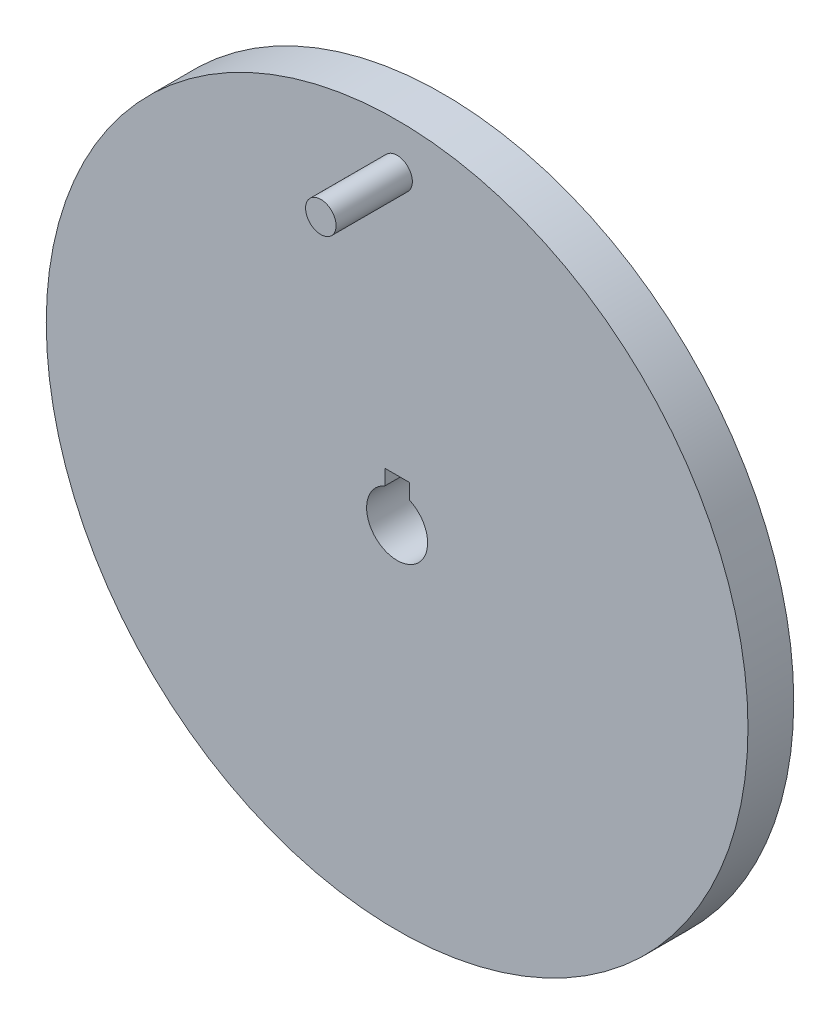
ISO-10303-21;
HEADER;
FILE_DESCRIPTION(('STEP AP214'),'2;1');
FILE_NAME('part.step','',(''),(''),'','','');
FILE_SCHEMA(('AUTOMOTIVE_DESIGN { 1 0 10303 214 1 1 1 1 }'));
ENDSEC;
DATA;
#1=APPLICATION_CONTEXT('core data for automotive mechanical design processes');
#2=APPLICATION_PROTOCOL_DEFINITION('international standard','automotive_design',2000,#1);
#3=PRODUCT_CONTEXT('',#1,'mechanical');
#4=PRODUCT('Part','Part','',(#3));
#5=PRODUCT_RELATED_PRODUCT_CATEGORY('part','',(#4));
#6=PRODUCT_DEFINITION_FORMATION('','',#4);
#7=PRODUCT_DEFINITION_CONTEXT('part definition',#1,'design');
#8=PRODUCT_DEFINITION('design','',#6,#7);
#9=PRODUCT_DEFINITION_SHAPE('','',#8);
#10=(LENGTH_UNIT() NAMED_UNIT(*) SI_UNIT(.MILLI.,.METRE.));
#11=(NAMED_UNIT(*) PLANE_ANGLE_UNIT() SI_UNIT($,.RADIAN.));
#12=(NAMED_UNIT(*) SI_UNIT($,.STERADIAN.) SOLID_ANGLE_UNIT());
#13=UNCERTAINTY_MEASURE_WITH_UNIT(LENGTH_MEASURE(1.E-05),#10,'distance_accuracy_value','');
#14=(GEOMETRIC_REPRESENTATION_CONTEXT(3) GLOBAL_UNCERTAINTY_ASSIGNED_CONTEXT((#13)) GLOBAL_UNIT_ASSIGNED_CONTEXT((#10,
#11,#12)) REPRESENTATION_CONTEXT('',''));
#15=CARTESIAN_POINT('',(0.,0.,0.));
#16=DIRECTION('',(0.,0.,1.));
#17=DIRECTION('',(1.,0.,0.));
#18=AXIS2_PLACEMENT_3D('',#15,#16,#17);
#19=CARTESIAN_POINT('',(0.,0.,0.));
#20=DIRECTION('',(0.,0.,0.999999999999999));
#21=DIRECTION('',(1.,0.,0.));
#22=AXIS2_PLACEMENT_3D('',#19,#20,#21);
#23=PLANE('',#22);
#24=CARTESIAN_POINT('',(0.,0.,0.));
#25=DIRECTION('',(0.,0.,0.999999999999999));
#26=DIRECTION('',(1.,0.,0.));
#27=AXIS2_PLACEMENT_3D('',#24,#25,#26);
#28=CIRCLE('',#27,10.);
#29=CARTESIAN_POINT('',(-4.,9.16515138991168,0.));
#30=VERTEX_POINT('',#29);
#31=CARTESIAN_POINT('',(4.,9.16515138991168,0.));
#32=VERTEX_POINT('',#31);
#33=EDGE_CURVE('E48',#30,#32,#28,.T.);
#34=ORIENTED_EDGE('',*,*,#33,.F.);
#35=DIRECTION('',(0.,-1.,0.));
#36=VECTOR('',#35,1.);
#37=CARTESIAN_POINT('',(-4.,9.16515138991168,0.));
#38=LINE('',#37,#36);
#39=CARTESIAN_POINT('',(-4.,14.1651513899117,0.));
#40=VERTEX_POINT('',#39);
#41=EDGE_CURVE('E91',#40,#30,#38,.T.);
#42=ORIENTED_EDGE('',*,*,#41,.F.);
#43=DIRECTION('',(-1.,0.,0.));
#44=VECTOR('',#43,1.);
#45=CARTESIAN_POINT('',(4.,14.1651513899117,0.));
#46=LINE('',#45,#44);
#47=CARTESIAN_POINT('',(4.,14.1651513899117,0.));
#48=VERTEX_POINT('',#47);
#49=EDGE_CURVE('E76',#48,#40,#46,.T.);
#50=ORIENTED_EDGE('',*,*,#49,.F.);
#51=DIRECTION('',(0.,1.,0.));
#52=VECTOR('',#51,1.);
#53=CARTESIAN_POINT('',(4.,9.16515138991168,0.));
#54=LINE('',#53,#52);
#55=EDGE_CURVE('E85',#32,#48,#54,.T.);
#56=ORIENTED_EDGE('',*,*,#55,.F.);
#57=EDGE_LOOP('',(#34,#42,#50,#56));
#58=FACE_BOUND('',#57,.T.);
#59=CARTESIAN_POINT('',(0.,0.,0.));
#60=DIRECTION('',(0.,0.,0.999999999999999));
#61=DIRECTION('',(1.,0.,0.));
#62=AXIS2_PLACEMENT_3D('',#59,#60,#61);
#63=CIRCLE('',#62,115.);
#64=CARTESIAN_POINT('',(115.,0.,0.));
#65=VERTEX_POINT('',#64);
#66=EDGE_CURVE('E41',#65,#65,#63,.T.);
#67=ORIENTED_EDGE('',*,*,#66,.T.);
#68=EDGE_LOOP('',(#67));
#69=FACE_BOUND('',#68,.T.);
#70=CARTESIAN_POINT('',(0.,100.,0.));
#71=DIRECTION('',(0.,0.,0.999999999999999));
#72=DIRECTION('',(1.,0.,0.));
#73=AXIS2_PLACEMENT_3D('',#70,#71,#72);
#74=CIRCLE('',#73,5.);
#75=CARTESIAN_POINT('',(-5.,100.,0.));
#76=VERTEX_POINT('',#75);
#77=EDGE_CURVE('E107',#76,#76,#74,.T.);
#78=ORIENTED_EDGE('',*,*,#77,.F.);
#79=EDGE_LOOP('',(#78));
#80=FACE_BOUND('',#79,.T.);
#81=ADVANCED_FACE('F33',(#58,#69,#80),#23,.T.);
#82=CARTESIAN_POINT('',(0.,0.,-15.));
#83=DIRECTION('',(0.,0.,0.999999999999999));
#84=DIRECTION('',(1.,0.,0.));
#85=AXIS2_PLACEMENT_3D('',#82,#83,#84);
#86=CYLINDRICAL_SURFACE('',#85,115.);
#87=CARTESIAN_POINT('',(0.,0.,-15.));
#88=DIRECTION('',(0.,0.,0.999999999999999));
#89=DIRECTION('',(1.,0.,0.));
#90=AXIS2_PLACEMENT_3D('',#87,#88,#89);
#91=CIRCLE('',#90,115.);
#92=CARTESIAN_POINT('',(115.,0.,-15.));
#93=VERTEX_POINT('',#92);
#94=EDGE_CURVE('E11',#93,#93,#91,.T.);
#95=CARTESIAN_POINT('',(115.,0.,-15.));
#96=CARTESIAN_POINT('',(115.,0.,-14.84375));
#97=CARTESIAN_POINT('',(115.,0.,-14.6875));
#98=CARTESIAN_POINT('',(115.,0.,-14.375));
#99=CARTESIAN_POINT('',(115.,0.,-14.21875));
#100=CARTESIAN_POINT('',(115.,0.,-13.90625));
#101=CARTESIAN_POINT('',(115.,0.,-13.75));
#102=CARTESIAN_POINT('',(115.,0.,-13.4375));
#103=CARTESIAN_POINT('',(115.,0.,-13.28125));
#104=CARTESIAN_POINT('',(115.,0.,-12.96875));
#105=CARTESIAN_POINT('',(115.,0.,-12.8125));
#106=CARTESIAN_POINT('',(115.,0.,-12.5));
#107=CARTESIAN_POINT('',(115.,0.,-12.34375));
#108=CARTESIAN_POINT('',(115.,0.,-12.03125));
#109=CARTESIAN_POINT('',(115.,0.,-11.875));
#110=CARTESIAN_POINT('',(115.,0.,-11.5625));
#111=CARTESIAN_POINT('',(115.,0.,-11.40625));
#112=CARTESIAN_POINT('',(115.,0.,-11.09375));
#113=CARTESIAN_POINT('',(115.,0.,-10.9375));
#114=CARTESIAN_POINT('',(115.,0.,-10.625));
#115=CARTESIAN_POINT('',(115.,0.,-10.46875));
#116=CARTESIAN_POINT('',(115.,0.,-10.15625));
#117=CARTESIAN_POINT('',(115.,0.,-9.99999999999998));
#118=CARTESIAN_POINT('',(115.,0.,-9.68749999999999));
#119=CARTESIAN_POINT('',(115.,0.,-9.53124999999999));
#120=CARTESIAN_POINT('',(115.,0.,-9.21874999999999));
#121=CARTESIAN_POINT('',(115.,0.,-9.06249999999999));
#122=CARTESIAN_POINT('',(115.,0.,-8.74999999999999));
#123=CARTESIAN_POINT('',(115.,0.,-8.59374999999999));
#124=CARTESIAN_POINT('',(115.,0.,-8.28124999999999));
#125=CARTESIAN_POINT('',(115.,0.,-8.12499999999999));
#126=CARTESIAN_POINT('',(115.,0.,-7.81249999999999));
#127=CARTESIAN_POINT('',(115.,0.,-7.65624999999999));
#128=CARTESIAN_POINT('',(115.,0.,-7.34374999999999));
#129=CARTESIAN_POINT('',(115.,0.,-7.18749999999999));
#130=CARTESIAN_POINT('',(115.,0.,-6.87499999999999));
#131=CARTESIAN_POINT('',(115.,0.,-6.71874999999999));
#132=CARTESIAN_POINT('',(115.,0.,-6.40624999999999));
#133=CARTESIAN_POINT('',(115.,0.,-6.24999999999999));
#134=CARTESIAN_POINT('',(115.,0.,-5.93749999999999));
#135=CARTESIAN_POINT('',(115.,0.,-5.78124999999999));
#136=CARTESIAN_POINT('',(115.,0.,-5.46874999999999));
#137=CARTESIAN_POINT('',(115.,0.,-5.31249999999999));
#138=CARTESIAN_POINT('',(115.,0.,-4.99999999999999));
#139=CARTESIAN_POINT('',(115.,0.,-4.84374999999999));
#140=CARTESIAN_POINT('',(115.,0.,-4.53124999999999));
#141=CARTESIAN_POINT('',(115.,0.,-4.37499999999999));
#142=CARTESIAN_POINT('',(115.,0.,-4.06249999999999));
#143=CARTESIAN_POINT('',(115.,0.,-3.90624999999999));
#144=CARTESIAN_POINT('',(115.,0.,-3.59374999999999));
#145=CARTESIAN_POINT('',(115.,0.,-3.43749999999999));
#146=CARTESIAN_POINT('',(115.,0.,-3.12499999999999));
#147=CARTESIAN_POINT('',(115.,0.,-2.96874999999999));
#148=CARTESIAN_POINT('',(115.,0.,-2.65625));
#149=CARTESIAN_POINT('',(115.,0.,-2.5));
#150=CARTESIAN_POINT('',(115.,0.,-2.1875));
#151=CARTESIAN_POINT('',(115.,0.,-2.03125));
#152=CARTESIAN_POINT('',(115.,0.,-1.71875));
#153=CARTESIAN_POINT('',(115.,0.,-1.5625));
#154=CARTESIAN_POINT('',(115.,0.,-1.25));
#155=CARTESIAN_POINT('',(115.,0.,-1.09375));
#156=CARTESIAN_POINT('',(115.,0.,-0.781249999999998));
#157=CARTESIAN_POINT('',(115.,0.,-0.624999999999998));
#158=CARTESIAN_POINT('',(115.,0.,-0.312499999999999));
#159=CARTESIAN_POINT('',(115.,0.,-0.156249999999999));
#160=CARTESIAN_POINT('',(115.,0.,0.));
#161=B_SPLINE_CURVE_WITH_KNOTS('',3,(#95,#96,#97,#98,#99,#100,#101,#102,#103,#104,#105,#106,
#107,#108,#109,#110,#111,#112,#113,#114,#115,#116,#117,#118,#119,#120,#121,#122,#123,#124,#125,
#126,#127,#128,#129,#130,#131,#132,#133,#134,#135,#136,#137,#138,#139,#140,#141,#142,#143,#144,
#145,#146,#147,#148,#149,#150,#151,#152,#153,#154,#155,#156,#157,#158,#159,#160),.UNSPECIFIED.,
.F.,.F.,(4,2,2,2,2,2,2,2,2,2,2,2,2,2,2,2,2,2,2,2,2,2,2,2,2,2,2,2,2,2,2,2,4),(0.,
0.468749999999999,0.937499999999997,1.40625,1.875,2.34375,2.81249999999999,3.28124999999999,
3.74999999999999,4.21874999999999,4.68749999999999,5.15624999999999,5.62499999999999,
6.09374999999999,6.56249999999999,7.03124999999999,7.49999999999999,7.96874999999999,
8.43749999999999,8.90624999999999,9.37499999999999,9.84374999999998,10.3125,10.78125,11.25,
11.71875,12.1875,12.65625,13.125,13.59375,14.0625,14.53125,15.),.UNSPECIFIED.);
#162=EDGE_CURVE('BSEAM35',#93,#65,#161,.T.);
#163=ORIENTED_EDGE('',*,*,#94,.T.);
#164=ORIENTED_EDGE('',*,*,#66,.F.);
#165=ORIENTED_EDGE('',*,*,#162,.T.);
#166=ORIENTED_EDGE('',*,*,#162,.F.);
#167=EDGE_LOOP('',(#163,#165,#164,#166));
#168=FACE_BOUND('',#167,.T.);
#169=ADVANCED_FACE('F35',(#168),#86,.T.);
#170=CARTESIAN_POINT('',(0.,0.,-15.));
#171=DIRECTION('',(0.,0.,0.999999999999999));
#172=DIRECTION('',(1.,0.,0.));
#173=AXIS2_PLACEMENT_3D('',#170,#171,#172);
#174=PLANE('',#173);
#175=DIRECTION('',(0.,-1.,0.));
#176=VECTOR('',#175,1.);
#177=CARTESIAN_POINT('',(-4.,9.16515138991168,-15.));
#178=LINE('',#177,#176);
#179=CARTESIAN_POINT('',(-4.,14.1651513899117,-15.));
#180=VERTEX_POINT('',#179);
#181=CARTESIAN_POINT('',(-4.,9.16515138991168,-15.));
#182=VERTEX_POINT('',#181);
#183=EDGE_CURVE('E102',#180,#182,#178,.T.);
#184=ORIENTED_EDGE('',*,*,#183,.T.);
#185=CARTESIAN_POINT('',(0.,0.,-15.));
#186=DIRECTION('',(0.,0.,0.999999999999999));
#187=DIRECTION('',(1.,0.,0.));
#188=AXIS2_PLACEMENT_3D('',#185,#186,#187);
#189=CIRCLE('',#188,10.);
#190=CARTESIAN_POINT('',(4.,9.16515138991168,-15.));
#191=VERTEX_POINT('',#190);
#192=EDGE_CURVE('E93',#182,#191,#189,.T.);
#193=ORIENTED_EDGE('',*,*,#192,.T.);
#194=DIRECTION('',(0.,1.,0.));
#195=VECTOR('',#194,1.);
#196=CARTESIAN_POINT('',(4.,9.16515138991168,-15.));
#197=LINE('',#196,#195);
#198=CARTESIAN_POINT('',(4.,14.1651513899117,-15.));
#199=VERTEX_POINT('',#198);
#200=EDGE_CURVE('E99',#191,#199,#197,.T.);
#201=ORIENTED_EDGE('',*,*,#200,.T.);
#202=DIRECTION('',(-1.,0.,0.));
#203=VECTOR('',#202,1.);
#204=CARTESIAN_POINT('',(4.,14.1651513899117,-15.));
#205=LINE('',#204,#203);
#206=EDGE_CURVE('E56',#199,#180,#205,.T.);
#207=ORIENTED_EDGE('',*,*,#206,.T.);
#208=EDGE_LOOP('',(#184,#193,#201,#207));
#209=FACE_BOUND('',#208,.T.);
#210=ORIENTED_EDGE('',*,*,#94,.F.);
#211=EDGE_LOOP('',(#210));
#212=FACE_BOUND('',#211,.T.);
#213=ADVANCED_FACE('F119',(#209,#212),#174,.F.);
#214=CARTESIAN_POINT('',(0.,100.,25.));
#215=DIRECTION('',(0.,0.,-0.999999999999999));
#216=DIRECTION('',(-1.,0.,0.));
#217=AXIS2_PLACEMENT_3D('',#214,#215,#216);
#218=CYLINDRICAL_SURFACE('',#217,5.);
#219=CARTESIAN_POINT('',(0.,100.,25.));
#220=DIRECTION('',(0.,0.,0.999999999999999));
#221=DIRECTION('',(1.,0.,0.));
#222=AXIS2_PLACEMENT_3D('',#219,#220,#221);
#223=CIRCLE('',#222,5.);
#224=CARTESIAN_POINT('',(-5.,100.,25.));
#225=VERTEX_POINT('',#224);
#226=EDGE_CURVE('E112',#225,#225,#223,.T.);
#227=CARTESIAN_POINT('',(-5.,100.,25.));
#228=CARTESIAN_POINT('',(-5.,100.,24.7395833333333));
#229=CARTESIAN_POINT('',(-5.,100.,24.4791666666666));
#230=CARTESIAN_POINT('',(-5.,100.,23.9583333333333));
#231=CARTESIAN_POINT('',(-5.,100.,23.6979166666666));
#232=CARTESIAN_POINT('',(-5.,100.,23.1770833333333));
#233=CARTESIAN_POINT('',(-5.,100.,22.9166666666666));
#234=CARTESIAN_POINT('',(-5.,100.,22.3958333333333));
#235=CARTESIAN_POINT('',(-5.,100.,22.1354166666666));
#236=CARTESIAN_POINT('',(-5.,100.,21.6145833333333));
#237=CARTESIAN_POINT('',(-5.,100.,21.3541666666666));
#238=CARTESIAN_POINT('',(-5.,100.,20.8333333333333));
#239=CARTESIAN_POINT('',(-5.,100.,20.5729166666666));
#240=CARTESIAN_POINT('',(-5.,100.,20.0520833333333));
#241=CARTESIAN_POINT('',(-5.,100.,19.7916666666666));
#242=CARTESIAN_POINT('',(-5.,100.,19.2708333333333));
#243=CARTESIAN_POINT('',(-5.,100.,19.0104166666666));
#244=CARTESIAN_POINT('',(-5.,100.,18.4895833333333));
#245=CARTESIAN_POINT('',(-5.,100.,18.2291666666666));
#246=CARTESIAN_POINT('',(-5.,100.,17.7083333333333));
#247=CARTESIAN_POINT('',(-5.,100.,17.4479166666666));
#248=CARTESIAN_POINT('',(-5.,100.,16.9270833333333));
#249=CARTESIAN_POINT('',(-5.,100.,16.6666666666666));
#250=CARTESIAN_POINT('',(-5.,100.,16.1458333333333));
#251=CARTESIAN_POINT('',(-5.,100.,15.8854166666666));
#252=CARTESIAN_POINT('',(-5.,100.,15.3645833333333));
#253=CARTESIAN_POINT('',(-5.,100.,15.1041666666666));
#254=CARTESIAN_POINT('',(-5.,100.,14.5833333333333));
#255=CARTESIAN_POINT('',(-5.,100.,14.3229166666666));
#256=CARTESIAN_POINT('',(-5.,100.,13.8020833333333));
#257=CARTESIAN_POINT('',(-5.,100.,13.5416666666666));
#258=CARTESIAN_POINT('',(-5.,100.,13.0208333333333));
#259=CARTESIAN_POINT('',(-5.,100.,12.7604166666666));
#260=CARTESIAN_POINT('',(-5.,100.,12.2395833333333));
#261=CARTESIAN_POINT('',(-5.,100.,11.9791666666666));
#262=CARTESIAN_POINT('',(-5.,100.,11.4583333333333));
#263=CARTESIAN_POINT('',(-5.,100.,11.1979166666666));
#264=CARTESIAN_POINT('',(-5.,100.,10.6770833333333));
#265=CARTESIAN_POINT('',(-5.,100.,10.4166666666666));
#266=CARTESIAN_POINT('',(-5.,100.,9.89583333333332));
#267=CARTESIAN_POINT('',(-5.,100.,9.63541666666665));
#268=CARTESIAN_POINT('',(-5.,100.,9.11458333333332));
#269=CARTESIAN_POINT('',(-5.,100.,8.85416666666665));
#270=CARTESIAN_POINT('',(-5.,100.,8.33333333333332));
#271=CARTESIAN_POINT('',(-5.,100.,8.07291666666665));
#272=CARTESIAN_POINT('',(-5.,100.,7.55208333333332));
#273=CARTESIAN_POINT('',(-5.,100.,7.29166666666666));
#274=CARTESIAN_POINT('',(-5.,100.,6.77083333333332));
#275=CARTESIAN_POINT('',(-5.,100.,6.51041666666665));
#276=CARTESIAN_POINT('',(-5.,100.,5.98958333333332));
#277=CARTESIAN_POINT('',(-5.,100.,5.72916666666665));
#278=CARTESIAN_POINT('',(-5.,100.,5.20833333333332));
#279=CARTESIAN_POINT('',(-5.,100.,4.94791666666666));
#280=CARTESIAN_POINT('',(-5.,100.,4.42708333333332));
#281=CARTESIAN_POINT('',(-5.,100.,4.16666666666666));
#282=CARTESIAN_POINT('',(-5.,100.,3.64583333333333));
#283=CARTESIAN_POINT('',(-5.,100.,3.38541666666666));
#284=CARTESIAN_POINT('',(-5.,100.,2.86458333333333));
#285=CARTESIAN_POINT('',(-5.,100.,2.60416666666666));
#286=CARTESIAN_POINT('',(-5.,100.,2.08333333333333));
#287=CARTESIAN_POINT('',(-5.,100.,1.82291666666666));
#288=CARTESIAN_POINT('',(-5.,100.,1.30208333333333));
#289=CARTESIAN_POINT('',(-5.,100.,1.04166666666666));
#290=CARTESIAN_POINT('',(-5.,100.,0.520833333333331));
#291=CARTESIAN_POINT('',(-5.,100.,0.260416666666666));
#292=CARTESIAN_POINT('',(-5.,100.,0.));
#293=B_SPLINE_CURVE_WITH_KNOTS('',3,(#227,#228,#229,#230,#231,#232,#233,#234,#235,#236,#237,
#238,#239,#240,#241,#242,#243,#244,#245,#246,#247,#248,#249,#250,#251,#252,#253,#254,#255,#256,
#257,#258,#259,#260,#261,#262,#263,#264,#265,#266,#267,#268,#269,#270,#271,#272,#273,#274,#275,
#276,#277,#278,#279,#280,#281,#282,#283,#284,#285,#286,#287,#288,#289,#290,#291,#292),
.UNSPECIFIED.,.F.,.F.,(4,2,2,2,2,2,2,2,2,2,2,2,2,2,2,2,2,2,2,2,2,2,2,2,2,2,2,2,2,2,2,2,4),(0.,
0.781250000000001,1.5625,2.34375,3.125,3.90625,4.68749999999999,5.46874999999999,
6.24999999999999,7.03124999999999,7.81249999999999,8.59374999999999,9.37499999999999,10.15625,
10.9375,11.71875,12.5,13.28125,14.0625,14.84375,15.625,16.40625,17.1875,17.96875,18.75,19.53125,
20.3125,21.09375,21.875,22.65625,23.4375,24.21875,25.),.UNSPECIFIED.);
#294=EDGE_CURVE('BSEAM125',#225,#76,#293,.T.);
#295=ORIENTED_EDGE('',*,*,#226,.F.);
#296=ORIENTED_EDGE('',*,*,#77,.T.);
#297=ORIENTED_EDGE('',*,*,#294,.T.);
#298=ORIENTED_EDGE('',*,*,#294,.F.);
#299=EDGE_LOOP('',(#295,#297,#296,#298));
#300=FACE_BOUND('',#299,.T.);
#301=ADVANCED_FACE('F125',(#300),#218,.T.);
#302=CARTESIAN_POINT('',(0.,100.,25.));
#303=DIRECTION('',(0.,0.,0.999999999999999));
#304=DIRECTION('',(1.,0.,0.));
#305=AXIS2_PLACEMENT_3D('',#302,#303,#304);
#306=PLANE('',#305);
#307=ORIENTED_EDGE('',*,*,#226,.T.);
#308=EDGE_LOOP('',(#307));
#309=FACE_BOUND('',#308,.T.);
#310=ADVANCED_FACE('F135',(#309),#306,.T.);
#311=CARTESIAN_POINT('',(0.,0.,-15.));
#312=DIRECTION('',(0.,0.,0.999999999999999));
#313=DIRECTION('',(1.,0.,0.));
#314=AXIS2_PLACEMENT_3D('',#311,#312,#313);
#315=CYLINDRICAL_SURFACE('',#314,10.);
#316=ORIENTED_EDGE('',*,*,#33,.T.);
#317=DIRECTION('',(0.,0.,0.999999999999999));
#318=VECTOR('',#317,1.);
#319=CARTESIAN_POINT('',(4.,9.16515138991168,-15.));
#320=LINE('',#319,#318);
#321=EDGE_CURVE('E82',#191,#32,#320,.T.);
#322=ORIENTED_EDGE('',*,*,#321,.F.);
#323=ORIENTED_EDGE('',*,*,#192,.F.);
#324=DIRECTION('',(0.,0.,0.999999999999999));
#325=VECTOR('',#324,1.);
#326=CARTESIAN_POINT('',(-4.,9.16515138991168,-15.));
#327=LINE('',#326,#325);
#328=EDGE_CURVE('E105',#182,#30,#327,.T.);
#329=ORIENTED_EDGE('',*,*,#328,.T.);
#330=EDGE_LOOP('',(#316,#322,#323,#329));
#331=FACE_BOUND('',#330,.T.);
#332=ADVANCED_FACE('F139',(#331),#315,.F.);
#333=CARTESIAN_POINT('',(-4.,9.16515138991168,-15.));
#334=DIRECTION('',(-1.,0.,0.));
#335=DIRECTION('',(0.,0.,0.999999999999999));
#336=AXIS2_PLACEMENT_3D('',#333,#334,#335);
#337=PLANE('',#336);
#338=ORIENTED_EDGE('',*,*,#41,.T.);
#339=ORIENTED_EDGE('',*,*,#328,.F.);
#340=ORIENTED_EDGE('',*,*,#183,.F.);
#341=DIRECTION('',(0.,0.,0.999999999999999));
#342=VECTOR('',#341,1.);
#343=CARTESIAN_POINT('',(-4.,14.1651513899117,-15.));
#344=LINE('',#343,#342);
#345=EDGE_CURVE('E81',#180,#40,#344,.T.);
#346=ORIENTED_EDGE('',*,*,#345,.T.);
#347=EDGE_LOOP('',(#338,#339,#340,#346));
#348=FACE_BOUND('',#347,.T.);
#349=ADVANCED_FACE('F143',(#348),#337,.F.);
#350=CARTESIAN_POINT('',(4.,14.1651513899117,-15.));
#351=DIRECTION('',(0.,1.,0.));
#352=DIRECTION('',(0.,0.,0.999999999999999));
#353=AXIS2_PLACEMENT_3D('',#350,#351,#352);
#354=PLANE('',#353);
#355=ORIENTED_EDGE('',*,*,#49,.T.);
#356=ORIENTED_EDGE('',*,*,#345,.F.);
#357=ORIENTED_EDGE('',*,*,#206,.F.);
#358=DIRECTION('',(0.,0.,0.999999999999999));
#359=VECTOR('',#358,1.);
#360=CARTESIAN_POINT('',(4.,14.1651513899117,-15.));
#361=LINE('',#360,#359);
#362=EDGE_CURVE('E72',#199,#48,#361,.T.);
#363=ORIENTED_EDGE('',*,*,#362,.T.);
#364=EDGE_LOOP('',(#355,#356,#357,#363));
#365=FACE_BOUND('',#364,.T.);
#366=ADVANCED_FACE('F74',(#365),#354,.F.);
#367=CARTESIAN_POINT('',(4.,9.16515138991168,-15.));
#368=DIRECTION('',(1.,0.,0.));
#369=DIRECTION('',(0.,0.,-0.999999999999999));
#370=AXIS2_PLACEMENT_3D('',#367,#368,#369);
#371=PLANE('',#370);
#372=ORIENTED_EDGE('',*,*,#55,.T.);
#373=ORIENTED_EDGE('',*,*,#362,.F.);
#374=ORIENTED_EDGE('',*,*,#200,.F.);
#375=ORIENTED_EDGE('',*,*,#321,.T.);
#376=EDGE_LOOP('',(#372,#373,#374,#375));
#377=FACE_BOUND('',#376,.T.);
#378=ADVANCED_FACE('F86',(#377),#371,.F.);
#379=CLOSED_SHELL('',(#81,#169,#213,#301,#310,#332,#349,#366,#378));
#380=MANIFOLD_SOLID_BREP('B2',#379);
#381=ADVANCED_BREP_SHAPE_REPRESENTATION('',(#18,#380),#14);
#382=SHAPE_DEFINITION_REPRESENTATION(#9,#381);
ENDSEC;
END-ISO-10303-21;
